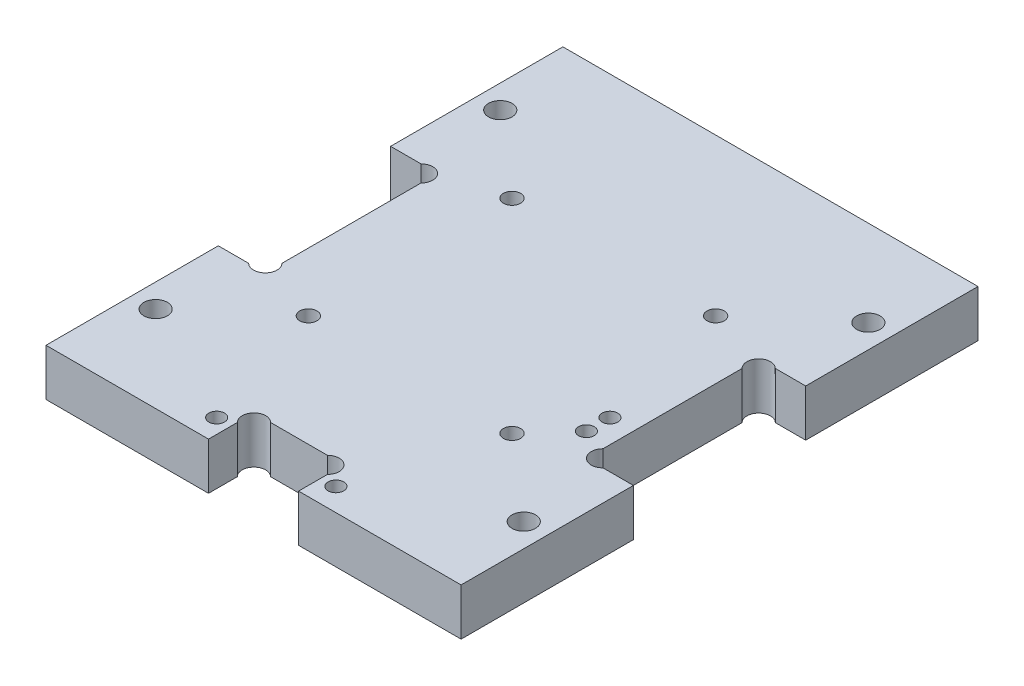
ISO-10303-21;
HEADER;
FILE_DESCRIPTION(('STEP AP214'),'2;1');
FILE_NAME('part.step','',(''),(''),'','','');
FILE_SCHEMA(('AUTOMOTIVE_DESIGN { 1 0 10303 214 1 1 1 1 }'));
ENDSEC;
DATA;
#1=APPLICATION_CONTEXT('core data for automotive mechanical design processes');
#2=APPLICATION_PROTOCOL_DEFINITION('international standard','automotive_design',2000,#1);
#3=PRODUCT_CONTEXT('',#1,'mechanical');
#4=PRODUCT('Part','Part','',(#3));
#5=PRODUCT_RELATED_PRODUCT_CATEGORY('part','',(#4));
#6=PRODUCT_DEFINITION_FORMATION('','',#4);
#7=PRODUCT_DEFINITION_CONTEXT('part definition',#1,'design');
#8=PRODUCT_DEFINITION('design','',#6,#7);
#9=PRODUCT_DEFINITION_SHAPE('','',#8);
#10=(LENGTH_UNIT() NAMED_UNIT(*) SI_UNIT(.MILLI.,.METRE.));
#11=(NAMED_UNIT(*) PLANE_ANGLE_UNIT() SI_UNIT($,.RADIAN.));
#12=(NAMED_UNIT(*) SI_UNIT($,.STERADIAN.) SOLID_ANGLE_UNIT());
#13=UNCERTAINTY_MEASURE_WITH_UNIT(LENGTH_MEASURE(1.E-05),#10,'distance_accuracy_value','');
#14=(GEOMETRIC_REPRESENTATION_CONTEXT(3) GLOBAL_UNCERTAINTY_ASSIGNED_CONTEXT((#13)) GLOBAL_UNIT_ASSIGNED_CONTEXT((#10,
#11,#12)) REPRESENTATION_CONTEXT('',''));
#15=CARTESIAN_POINT('',(0.,0.,0.));
#16=DIRECTION('',(0.,0.,1.));
#17=DIRECTION('',(1.,0.,0.));
#18=AXIS2_PLACEMENT_3D('',#15,#16,#17);
#19=CARTESIAN_POINT('',(-12.0606601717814,6.,-9.93933982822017));
#20=DIRECTION('',(0.,1.,0.));
#21=DIRECTION('',(0.,0.,1.));
#22=AXIS2_PLACEMENT_3D('',#19,#20,#21);
#23=PLANE('',#22);
#24=CARTESIAN_POINT('',(26.9999999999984,6.,5.));
#25=DIRECTION('',(0.,1.,0.));
#26=DIRECTION('',(0.,0.,1.));
#27=AXIS2_PLACEMENT_3D('',#24,#25,#26);
#28=CIRCLE('',#27,1.);
#29=CARTESIAN_POINT('',(26.9999999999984,6.,6.));
#30=VERTEX_POINT('',#29);
#31=EDGE_CURVE('E521',#30,#30,#28,.T.);
#32=ORIENTED_EDGE('',*,*,#31,.F.);
#33=EDGE_LOOP('',(#32));
#34=FACE_BOUND('',#33,.T.);
#35=CARTESIAN_POINT('',(1.88999999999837,6.,30.1));
#36=DIRECTION('',(0.,1.,0.));
#37=DIRECTION('',(0.,0.,1.));
#38=AXIS2_PLACEMENT_3D('',#35,#36,#37);
#39=CIRCLE('',#38,1.);
#40=CARTESIAN_POINT('',(1.88999999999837,6.,31.1));
#41=VERTEX_POINT('',#40);
#42=EDGE_CURVE('E533',#41,#41,#39,.T.);
#43=ORIENTED_EDGE('',*,*,#42,.F.);
#44=EDGE_LOOP('',(#43));
#45=FACE_BOUND('',#44,.T.);
#46=CARTESIAN_POINT('',(22.4999999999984,6.,-13.));
#47=DIRECTION('',(0.,1.,0.));
#48=DIRECTION('',(0.,0.,-1.));
#49=AXIS2_PLACEMENT_3D('',#46,#47,#48);
#50=CIRCLE('',#49,1.1);
#51=CARTESIAN_POINT('',(22.4999999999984,6.,-14.1));
#52=VERTEX_POINT('',#51);
#53=EDGE_CURVE('E545',#52,#52,#50,.T.);
#54=ORIENTED_EDGE('',*,*,#53,.F.);
#55=EDGE_LOOP('',(#54));
#56=FACE_BOUND('',#55,.T.);
#57=CARTESIAN_POINT('',(22.4999999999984,6.,13.));
#58=DIRECTION('',(0.,1.,0.));
#59=DIRECTION('',(0.,0.,1.));
#60=AXIS2_PLACEMENT_3D('',#57,#58,#59);
#61=CIRCLE('',#60,1.1);
#62=CARTESIAN_POINT('',(22.4999999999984,6.,14.1));
#63=VERTEX_POINT('',#62);
#64=EDGE_CURVE('E557',#63,#63,#61,.T.);
#65=ORIENTED_EDGE('',*,*,#64,.F.);
#66=EDGE_LOOP('',(#65));
#67=FACE_BOUND('',#66,.T.);
#68=CARTESIAN_POINT('',(-14.0000000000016,6.,22.));
#69=DIRECTION('',(0.,1.,0.));
#70=DIRECTION('',(0.,0.,-1.));
#71=AXIS2_PLACEMENT_3D('',#68,#69,#70);
#72=CIRCLE('',#71,1.5);
#73=CARTESIAN_POINT('',(-14.0000000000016,6.,20.5));
#74=VERTEX_POINT('',#73);
#75=EDGE_CURVE('E569',#74,#74,#72,.T.);
#76=ORIENTED_EDGE('',*,*,#75,.F.);
#77=EDGE_LOOP('',(#76));
#78=FACE_BOUND('',#77,.T.);
#79=CARTESIAN_POINT('',(-14.0000000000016,6.,-22.));
#80=DIRECTION('',(0.,1.,0.));
#81=DIRECTION('',(0.,0.,1.));
#82=AXIS2_PLACEMENT_3D('',#79,#80,#81);
#83=CIRCLE('',#82,1.5);
#84=CARTESIAN_POINT('',(-14.0000000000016,6.,-20.5));
#85=VERTEX_POINT('',#84);
#86=EDGE_CURVE('E203',#85,#85,#83,.T.);
#87=ORIENTED_EDGE('',*,*,#86,.F.);
#88=EDGE_LOOP('',(#87));
#89=FACE_BOUND('',#88,.T.);
#90=CARTESIAN_POINT('',(-12.0606601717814,6.,-9.93933982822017));
#91=DIRECTION('',(0.,-1.,0.));
#92=DIRECTION('',(0.,0.,1.));
#93=AXIS2_PLACEMENT_3D('',#90,#91,#92);
#94=CIRCLE('',#93,1.5);
#95=CARTESIAN_POINT('',(-13.1213203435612,6.,-11.));
#96=VERTEX_POINT('',#95);
#97=CARTESIAN_POINT('',(-11.0000000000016,6.,-8.87867965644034));
#98=VERTEX_POINT('',#97);
#99=EDGE_CURVE('E249',#96,#98,#94,.T.);
#100=ORIENTED_EDGE('',*,*,#99,.T.);
#101=DIRECTION('',(0.,0.,1.));
#102=VECTOR('',#101,1.);
#103=CARTESIAN_POINT('',(-11.0000000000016,6.,8.87867965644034));
#104=LINE('',#103,#102);
#105=CARTESIAN_POINT('',(-11.0000000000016,6.,8.87867965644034));
#106=VERTEX_POINT('',#105);
#107=EDGE_CURVE('E198',#98,#106,#104,.T.);
#108=ORIENTED_EDGE('',*,*,#107,.T.);
#109=CARTESIAN_POINT('',(-12.0606601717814,6.,9.93933982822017));
#110=DIRECTION('',(0.,-1.,0.));
#111=DIRECTION('',(0.,0.,-1.));
#112=AXIS2_PLACEMENT_3D('',#109,#110,#111);
#113=CIRCLE('',#112,1.5);
#114=CARTESIAN_POINT('',(-13.1213203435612,6.,11.));
#115=VERTEX_POINT('',#114);
#116=EDGE_CURVE('E252',#106,#115,#113,.T.);
#117=ORIENTED_EDGE('',*,*,#116,.T.);
#118=DIRECTION('',(-1.,0.,0.));
#119=VECTOR('',#118,1.);
#120=CARTESIAN_POINT('',(-13.1213203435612,6.,11.));
#121=LINE('',#120,#119);
#122=CARTESIAN_POINT('',(-17.0000000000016,6.,11.));
#123=VERTEX_POINT('',#122);
#124=EDGE_CURVE('E254',#115,#123,#121,.T.);
#125=ORIENTED_EDGE('',*,*,#124,.T.);
#126=DIRECTION('',(0.,0.,1.));
#127=VECTOR('',#126,1.);
#128=CARTESIAN_POINT('',(-17.0000000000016,6.,33.));
#129=LINE('',#128,#127);
#130=CARTESIAN_POINT('',(-17.0000000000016,6.,33.));
#131=VERTEX_POINT('',#130);
#132=EDGE_CURVE('E256',#123,#131,#129,.T.);
#133=ORIENTED_EDGE('',*,*,#132,.T.);
#134=DIRECTION('',(1.,0.,0.));
#135=VECTOR('',#134,1.);
#136=CARTESIAN_POINT('',(3.74999999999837,6.,33.));
#137=LINE('',#136,#135);
#138=CARTESIAN_POINT('',(3.74999999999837,6.,33.));
#139=VERTEX_POINT('',#138);
#140=EDGE_CURVE('E258',#131,#139,#137,.T.);
#141=ORIENTED_EDGE('',*,*,#140,.T.);
#142=DIRECTION('',(0.,0.,-1.));
#143=VECTOR('',#142,1.);
#144=CARTESIAN_POINT('',(3.74999999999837,6.,33.));
#145=LINE('',#144,#143);
#146=CARTESIAN_POINT('',(3.74999999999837,6.,29.3213203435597));
#147=VERTEX_POINT('',#146);
#148=EDGE_CURVE('E260',#139,#147,#145,.T.);
#149=ORIENTED_EDGE('',*,*,#148,.T.);
#150=CARTESIAN_POINT('',(4.81066017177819,6.,28.2606601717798));
#151=DIRECTION('',(0.,-1.,0.));
#152=DIRECTION('',(0.,0.,1.));
#153=AXIS2_PLACEMENT_3D('',#150,#151,#152);
#154=CIRCLE('',#153,1.5);
#155=CARTESIAN_POINT('',(5.87132034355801,6.,27.2));
#156=VERTEX_POINT('',#155);
#157=EDGE_CURVE('E262',#147,#156,#154,.T.);
#158=ORIENTED_EDGE('',*,*,#157,.T.);
#159=DIRECTION('',(1.,0.,0.));
#160=VECTOR('',#159,1.);
#161=CARTESIAN_POINT('',(5.87132034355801,6.,27.2));
#162=LINE('',#161,#160);
#163=CARTESIAN_POINT('',(13.1286796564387,6.,27.2));
#164=VERTEX_POINT('',#163);
#165=EDGE_CURVE('E264',#156,#164,#162,.T.);
#166=ORIENTED_EDGE('',*,*,#165,.T.);
#167=CARTESIAN_POINT('',(14.1893398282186,6.,28.2606601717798));
#168=DIRECTION('',(0.,-1.,0.));
#169=DIRECTION('',(0.,0.,-1.));
#170=AXIS2_PLACEMENT_3D('',#167,#168,#169);
#171=CIRCLE('',#170,1.5);
#172=CARTESIAN_POINT('',(15.2499999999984,6.,29.3213203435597));
#173=VERTEX_POINT('',#172);
#174=EDGE_CURVE('E266',#164,#173,#171,.T.);
#175=ORIENTED_EDGE('',*,*,#174,.T.);
#176=DIRECTION('',(0.,0.,1.));
#177=VECTOR('',#176,1.);
#178=CARTESIAN_POINT('',(15.2499999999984,6.,33.));
#179=LINE('',#178,#177);
#180=CARTESIAN_POINT('',(15.2499999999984,6.,33.));
#181=VERTEX_POINT('',#180);
#182=EDGE_CURVE('E268',#173,#181,#179,.T.);
#183=ORIENTED_EDGE('',*,*,#182,.T.);
#184=DIRECTION('',(1.,0.,0.));
#185=VECTOR('',#184,1.);
#186=CARTESIAN_POINT('',(35.9999999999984,6.,33.));
#187=LINE('',#186,#185);
#188=CARTESIAN_POINT('',(35.9999999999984,6.,33.));
#189=VERTEX_POINT('',#188);
#190=EDGE_CURVE('E270',#181,#189,#187,.T.);
#191=ORIENTED_EDGE('',*,*,#190,.T.);
#192=DIRECTION('',(0.,0.,-1.));
#193=VECTOR('',#192,1.);
#194=CARTESIAN_POINT('',(35.9999999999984,6.,11.));
#195=LINE('',#194,#193);
#196=CARTESIAN_POINT('',(35.9999999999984,6.,11.));
#197=VERTEX_POINT('',#196);
#198=EDGE_CURVE('E272',#189,#197,#195,.T.);
#199=ORIENTED_EDGE('',*,*,#198,.T.);
#200=DIRECTION('',(-1.,0.,0.));
#201=VECTOR('',#200,1.);
#202=CARTESIAN_POINT('',(32.121320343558,6.,11.));
#203=LINE('',#202,#201);
#204=CARTESIAN_POINT('',(32.121320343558,6.,11.));
#205=VERTEX_POINT('',#204);
#206=EDGE_CURVE('E274',#197,#205,#203,.T.);
#207=ORIENTED_EDGE('',*,*,#206,.T.);
#208=CARTESIAN_POINT('',(31.0606601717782,6.,9.93933982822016));
#209=DIRECTION('',(0.,-1.,0.));
#210=DIRECTION('',(0.,0.,1.));
#211=AXIS2_PLACEMENT_3D('',#208,#209,#210);
#212=CIRCLE('',#211,1.5);
#213=CARTESIAN_POINT('',(29.9999999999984,6.,8.87867965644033));
#214=VERTEX_POINT('',#213);
#215=EDGE_CURVE('E276',#205,#214,#212,.T.);
#216=ORIENTED_EDGE('',*,*,#215,.T.);
#217=DIRECTION('',(0.,0.,-1.));
#218=VECTOR('',#217,1.);
#219=CARTESIAN_POINT('',(29.9999999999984,6.,8.87867965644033));
#220=LINE('',#219,#218);
#221=CARTESIAN_POINT('',(29.9999999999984,6.,-8.87867965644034));
#222=VERTEX_POINT('',#221);
#223=EDGE_CURVE('E278',#214,#222,#220,.T.);
#224=ORIENTED_EDGE('',*,*,#223,.T.);
#225=CARTESIAN_POINT('',(31.0606601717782,6.,-9.93933982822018));
#226=DIRECTION('',(0.,-1.,0.));
#227=DIRECTION('',(0.,0.,-1.));
#228=AXIS2_PLACEMENT_3D('',#225,#226,#227);
#229=CIRCLE('',#228,1.5);
#230=CARTESIAN_POINT('',(32.121320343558,6.,-11.));
#231=VERTEX_POINT('',#230);
#232=EDGE_CURVE('E280',#222,#231,#229,.T.);
#233=ORIENTED_EDGE('',*,*,#232,.T.);
#234=DIRECTION('',(1.,0.,0.));
#235=VECTOR('',#234,1.);
#236=CARTESIAN_POINT('',(32.121320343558,6.,-11.));
#237=LINE('',#236,#235);
#238=CARTESIAN_POINT('',(35.9999999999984,6.,-11.));
#239=VERTEX_POINT('',#238);
#240=EDGE_CURVE('E282',#231,#239,#237,.T.);
#241=ORIENTED_EDGE('',*,*,#240,.T.);
#242=DIRECTION('',(0.,0.,-1.));
#243=VECTOR('',#242,1.);
#244=CARTESIAN_POINT('',(35.9999999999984,6.,-33.));
#245=LINE('',#244,#243);
#246=CARTESIAN_POINT('',(35.9999999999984,6.,-33.));
#247=VERTEX_POINT('',#246);
#248=EDGE_CURVE('E284',#239,#247,#245,.T.);
#249=ORIENTED_EDGE('',*,*,#248,.T.);
#250=DIRECTION('',(-1.,0.,0.));
#251=VECTOR('',#250,1.);
#252=CARTESIAN_POINT('',(-17.0000000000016,6.,-33.));
#253=LINE('',#252,#251);
#254=CARTESIAN_POINT('',(-17.0000000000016,6.,-33.));
#255=VERTEX_POINT('',#254);
#256=EDGE_CURVE('E286',#247,#255,#253,.T.);
#257=ORIENTED_EDGE('',*,*,#256,.T.);
#258=DIRECTION('',(0.,0.,1.));
#259=VECTOR('',#258,1.);
#260=CARTESIAN_POINT('',(-17.0000000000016,6.,-11.));
#261=LINE('',#260,#259);
#262=CARTESIAN_POINT('',(-17.0000000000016,6.,-11.));
#263=VERTEX_POINT('',#262);
#264=EDGE_CURVE('E55',#255,#263,#261,.T.);
#265=ORIENTED_EDGE('',*,*,#264,.T.);
#266=DIRECTION('',(1.,0.,0.));
#267=VECTOR('',#266,1.);
#268=CARTESIAN_POINT('',(-13.1213203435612,6.,-11.));
#269=LINE('',#268,#267);
#270=EDGE_CURVE('E50',#263,#96,#269,.T.);
#271=ORIENTED_EDGE('',*,*,#270,.T.);
#272=EDGE_LOOP('',(#100,#108,#117,#125,#133,#141,#149,#158,#166,#175,#183,#191,#199,#207,#216,
#224,#233,#241,#249,#257,#265,#271));
#273=FACE_BOUND('',#272,.T.);
#274=CARTESIAN_POINT('',(32.9999999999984,6.,-22.));
#275=DIRECTION('',(0.,1.,0.));
#276=DIRECTION('',(0.,0.,-1.));
#277=AXIS2_PLACEMENT_3D('',#274,#275,#276);
#278=CIRCLE('',#277,1.5);
#279=CARTESIAN_POINT('',(32.9999999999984,6.,-23.5));
#280=VERTEX_POINT('',#279);
#281=EDGE_CURVE('E575',#280,#280,#278,.T.);
#282=ORIENTED_EDGE('',*,*,#281,.F.);
#283=EDGE_LOOP('',(#282));
#284=FACE_BOUND('',#283,.T.);
#285=CARTESIAN_POINT('',(32.9999999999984,6.,22.));
#286=DIRECTION('',(0.,1.,0.));
#287=DIRECTION('',(0.,0.,1.));
#288=AXIS2_PLACEMENT_3D('',#285,#286,#287);
#289=CIRCLE('',#288,1.5);
#290=CARTESIAN_POINT('',(32.9999999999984,6.,23.5));
#291=VERTEX_POINT('',#290);
#292=EDGE_CURVE('E563',#291,#291,#289,.T.);
#293=ORIENTED_EDGE('',*,*,#292,.F.);
#294=EDGE_LOOP('',(#293));
#295=FACE_BOUND('',#294,.T.);
#296=CARTESIAN_POINT('',(-3.50000000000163,6.,13.));
#297=DIRECTION('',(0.,1.,0.));
#298=DIRECTION('',(0.,0.,1.));
#299=AXIS2_PLACEMENT_3D('',#296,#297,#298);
#300=CIRCLE('',#299,1.1);
#301=CARTESIAN_POINT('',(-3.50000000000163,6.,14.1));
#302=VERTEX_POINT('',#301);
#303=EDGE_CURVE('E551',#302,#302,#300,.T.);
#304=ORIENTED_EDGE('',*,*,#303,.F.);
#305=EDGE_LOOP('',(#304));
#306=FACE_BOUND('',#305,.T.);
#307=CARTESIAN_POINT('',(-3.50000000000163,6.,-13.));
#308=DIRECTION('',(0.,1.,0.));
#309=DIRECTION('',(0.,0.,-1.));
#310=AXIS2_PLACEMENT_3D('',#307,#308,#309);
#311=CIRCLE('',#310,1.1);
#312=CARTESIAN_POINT('',(-3.50000000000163,6.,-14.1));
#313=VERTEX_POINT('',#312);
#314=EDGE_CURVE('E539',#313,#313,#311,.T.);
#315=ORIENTED_EDGE('',*,*,#314,.F.);
#316=EDGE_LOOP('',(#315));
#317=FACE_BOUND('',#316,.T.);
#318=CARTESIAN_POINT('',(17.1099999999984,6.,30.1));
#319=DIRECTION('',(0.,1.,0.));
#320=DIRECTION('',(0.,0.,-1.));
#321=AXIS2_PLACEMENT_3D('',#318,#319,#320);
#322=CIRCLE('',#321,1.);
#323=CARTESIAN_POINT('',(17.1099999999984,6.,29.1));
#324=VERTEX_POINT('',#323);
#325=EDGE_CURVE('E527',#324,#324,#322,.T.);
#326=ORIENTED_EDGE('',*,*,#325,.F.);
#327=EDGE_LOOP('',(#326));
#328=FACE_BOUND('',#327,.T.);
#329=CARTESIAN_POINT('',(26.9999999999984,6.,8.));
#330=DIRECTION('',(0.,1.,0.));
#331=DIRECTION('',(0.,0.,1.));
#332=AXIS2_PLACEMENT_3D('',#329,#330,#331);
#333=CIRCLE('',#332,1.);
#334=CARTESIAN_POINT('',(26.9999999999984,6.,9.));
#335=VERTEX_POINT('',#334);
#336=EDGE_CURVE('E510',#335,#335,#333,.T.);
#337=ORIENTED_EDGE('',*,*,#336,.F.);
#338=EDGE_LOOP('',(#337));
#339=FACE_BOUND('',#338,.T.);
#340=ADVANCED_FACE('F35',(#34,#45,#56,#67,#78,#89,#273,#284,#295,#306,#317,#328,#339),#23,.T.);
#341=CARTESIAN_POINT('',(-12.0606601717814,0.,-9.93933982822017));
#342=DIRECTION('',(0.,1.,0.));
#343=DIRECTION('',(0.,0.,1.));
#344=AXIS2_PLACEMENT_3D('',#341,#342,#343);
#345=PLANE('',#344);
#346=CARTESIAN_POINT('',(26.9999999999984,0.,5.));
#347=DIRECTION('',(0.,1.,0.));
#348=DIRECTION('',(0.,0.,1.));
#349=AXIS2_PLACEMENT_3D('',#346,#347,#348);
#350=CIRCLE('',#349,1.);
#351=CARTESIAN_POINT('',(26.9999999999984,0.,6.));
#352=VERTEX_POINT('',#351);
#353=EDGE_CURVE('E516',#352,#352,#350,.T.);
#354=ORIENTED_EDGE('',*,*,#353,.T.);
#355=EDGE_LOOP('',(#354));
#356=FACE_BOUND('',#355,.T.);
#357=CARTESIAN_POINT('',(1.88999999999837,0.,30.1));
#358=DIRECTION('',(0.,1.,0.));
#359=DIRECTION('',(0.,0.,1.));
#360=AXIS2_PLACEMENT_3D('',#357,#358,#359);
#361=CIRCLE('',#360,1.);
#362=CARTESIAN_POINT('',(1.88999999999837,0.,31.1));
#363=VERTEX_POINT('',#362);
#364=EDGE_CURVE('E530',#363,#363,#361,.T.);
#365=ORIENTED_EDGE('',*,*,#364,.T.);
#366=EDGE_LOOP('',(#365));
#367=FACE_BOUND('',#366,.T.);
#368=CARTESIAN_POINT('',(22.4999999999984,0.,-13.));
#369=DIRECTION('',(0.,1.,0.));
#370=DIRECTION('',(0.,0.,-1.));
#371=AXIS2_PLACEMENT_3D('',#368,#369,#370);
#372=CIRCLE('',#371,1.1);
#373=CARTESIAN_POINT('',(22.4999999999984,0.,-14.1));
#374=VERTEX_POINT('',#373);
#375=EDGE_CURVE('E542',#374,#374,#372,.T.);
#376=ORIENTED_EDGE('',*,*,#375,.T.);
#377=EDGE_LOOP('',(#376));
#378=FACE_BOUND('',#377,.T.);
#379=CARTESIAN_POINT('',(22.4999999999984,0.,13.));
#380=DIRECTION('',(0.,1.,0.));
#381=DIRECTION('',(0.,0.,1.));
#382=AXIS2_PLACEMENT_3D('',#379,#380,#381);
#383=CIRCLE('',#382,1.1);
#384=CARTESIAN_POINT('',(22.4999999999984,0.,14.1));
#385=VERTEX_POINT('',#384);
#386=EDGE_CURVE('E554',#385,#385,#383,.T.);
#387=ORIENTED_EDGE('',*,*,#386,.T.);
#388=EDGE_LOOP('',(#387));
#389=FACE_BOUND('',#388,.T.);
#390=CARTESIAN_POINT('',(-14.0000000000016,0.,22.));
#391=DIRECTION('',(0.,1.,0.));
#392=DIRECTION('',(0.,0.,-1.));
#393=AXIS2_PLACEMENT_3D('',#390,#391,#392);
#394=CIRCLE('',#393,1.5);
#395=CARTESIAN_POINT('',(-14.0000000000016,0.,20.5));
#396=VERTEX_POINT('',#395);
#397=EDGE_CURVE('E566',#396,#396,#394,.T.);
#398=ORIENTED_EDGE('',*,*,#397,.T.);
#399=EDGE_LOOP('',(#398));
#400=FACE_BOUND('',#399,.T.);
#401=CARTESIAN_POINT('',(-14.0000000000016,0.,-22.));
#402=DIRECTION('',(0.,1.,0.));
#403=DIRECTION('',(0.,0.,1.));
#404=AXIS2_PLACEMENT_3D('',#401,#402,#403);
#405=CIRCLE('',#404,1.5);
#406=CARTESIAN_POINT('',(-14.0000000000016,0.,-20.5));
#407=VERTEX_POINT('',#406);
#408=EDGE_CURVE('E206',#407,#407,#405,.T.);
#409=ORIENTED_EDGE('',*,*,#408,.T.);
#410=EDGE_LOOP('',(#409));
#411=FACE_BOUND('',#410,.T.);
#412=CARTESIAN_POINT('',(-12.0606601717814,0.,-9.93933982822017));
#413=DIRECTION('',(0.,-1.,0.));
#414=DIRECTION('',(0.,0.,1.));
#415=AXIS2_PLACEMENT_3D('',#412,#413,#414);
#416=CIRCLE('',#415,1.5);
#417=CARTESIAN_POINT('',(-13.1213203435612,0.,-11.));
#418=VERTEX_POINT('',#417);
#419=CARTESIAN_POINT('',(-11.0000000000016,0.,-8.87867965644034));
#420=VERTEX_POINT('',#419);
#421=EDGE_CURVE('E189',#418,#420,#416,.T.);
#422=ORIENTED_EDGE('',*,*,#421,.F.);
#423=DIRECTION('',(1.,0.,0.));
#424=VECTOR('',#423,1.);
#425=CARTESIAN_POINT('',(-13.1213203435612,0.,-11.));
#426=LINE('',#425,#424);
#427=CARTESIAN_POINT('',(-17.0000000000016,0.,-11.));
#428=VERTEX_POINT('',#427);
#429=EDGE_CURVE('E247',#428,#418,#426,.T.);
#430=ORIENTED_EDGE('',*,*,#429,.F.);
#431=DIRECTION('',(0.,0.,1.));
#432=VECTOR('',#431,1.);
#433=CARTESIAN_POINT('',(-17.0000000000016,0.,-11.));
#434=LINE('',#433,#432);
#435=CARTESIAN_POINT('',(-17.0000000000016,0.,-33.));
#436=VERTEX_POINT('',#435);
#437=EDGE_CURVE('E245',#436,#428,#434,.T.);
#438=ORIENTED_EDGE('',*,*,#437,.F.);
#439=DIRECTION('',(-1.,0.,0.));
#440=VECTOR('',#439,1.);
#441=CARTESIAN_POINT('',(-17.0000000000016,0.,-33.));
#442=LINE('',#441,#440);
#443=CARTESIAN_POINT('',(35.9999999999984,0.,-33.));
#444=VERTEX_POINT('',#443);
#445=EDGE_CURVE('E243',#444,#436,#442,.T.);
#446=ORIENTED_EDGE('',*,*,#445,.F.);
#447=DIRECTION('',(0.,0.,-1.));
#448=VECTOR('',#447,1.);
#449=CARTESIAN_POINT('',(35.9999999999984,0.,-33.));
#450=LINE('',#449,#448);
#451=CARTESIAN_POINT('',(35.9999999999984,0.,-11.));
#452=VERTEX_POINT('',#451);
#453=EDGE_CURVE('E241',#452,#444,#450,.T.);
#454=ORIENTED_EDGE('',*,*,#453,.F.);
#455=DIRECTION('',(1.,0.,0.));
#456=VECTOR('',#455,1.);
#457=CARTESIAN_POINT('',(32.121320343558,0.,-11.));
#458=LINE('',#457,#456);
#459=CARTESIAN_POINT('',(32.121320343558,0.,-11.));
#460=VERTEX_POINT('',#459);
#461=EDGE_CURVE('E239',#460,#452,#458,.T.);
#462=ORIENTED_EDGE('',*,*,#461,.F.);
#463=CARTESIAN_POINT('',(31.0606601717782,0.,-9.93933982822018));
#464=DIRECTION('',(0.,-1.,0.));
#465=DIRECTION('',(0.,0.,-1.));
#466=AXIS2_PLACEMENT_3D('',#463,#464,#465);
#467=CIRCLE('',#466,1.5);
#468=CARTESIAN_POINT('',(29.9999999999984,0.,-8.87867965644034));
#469=VERTEX_POINT('',#468);
#470=EDGE_CURVE('E237',#469,#460,#467,.T.);
#471=ORIENTED_EDGE('',*,*,#470,.F.);
#472=DIRECTION('',(0.,0.,-1.));
#473=VECTOR('',#472,1.);
#474=CARTESIAN_POINT('',(29.9999999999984,0.,8.87867965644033));
#475=LINE('',#474,#473);
#476=CARTESIAN_POINT('',(29.9999999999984,0.,8.87867965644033));
#477=VERTEX_POINT('',#476);
#478=EDGE_CURVE('E235',#477,#469,#475,.T.);
#479=ORIENTED_EDGE('',*,*,#478,.F.);
#480=CARTESIAN_POINT('',(31.0606601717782,0.,9.93933982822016));
#481=DIRECTION('',(0.,-1.,0.));
#482=DIRECTION('',(0.,0.,1.));
#483=AXIS2_PLACEMENT_3D('',#480,#481,#482);
#484=CIRCLE('',#483,1.5);
#485=CARTESIAN_POINT('',(32.121320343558,0.,11.));
#486=VERTEX_POINT('',#485);
#487=EDGE_CURVE('E233',#486,#477,#484,.T.);
#488=ORIENTED_EDGE('',*,*,#487,.F.);
#489=DIRECTION('',(-1.,0.,0.));
#490=VECTOR('',#489,1.);
#491=CARTESIAN_POINT('',(32.121320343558,0.,11.));
#492=LINE('',#491,#490);
#493=CARTESIAN_POINT('',(35.9999999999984,0.,11.));
#494=VERTEX_POINT('',#493);
#495=EDGE_CURVE('E231',#494,#486,#492,.T.);
#496=ORIENTED_EDGE('',*,*,#495,.F.);
#497=DIRECTION('',(0.,0.,-1.));
#498=VECTOR('',#497,1.);
#499=CARTESIAN_POINT('',(35.9999999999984,0.,11.));
#500=LINE('',#499,#498);
#501=CARTESIAN_POINT('',(35.9999999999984,0.,33.));
#502=VERTEX_POINT('',#501);
#503=EDGE_CURVE('E229',#502,#494,#500,.T.);
#504=ORIENTED_EDGE('',*,*,#503,.F.);
#505=DIRECTION('',(1.,0.,0.));
#506=VECTOR('',#505,1.);
#507=CARTESIAN_POINT('',(35.9999999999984,0.,33.));
#508=LINE('',#507,#506);
#509=CARTESIAN_POINT('',(15.2499999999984,0.,33.));
#510=VERTEX_POINT('',#509);
#511=EDGE_CURVE('E227',#510,#502,#508,.T.);
#512=ORIENTED_EDGE('',*,*,#511,.F.);
#513=DIRECTION('',(0.,0.,1.));
#514=VECTOR('',#513,1.);
#515=CARTESIAN_POINT('',(15.2499999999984,0.,33.));
#516=LINE('',#515,#514);
#517=CARTESIAN_POINT('',(15.2499999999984,0.,29.3213203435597));
#518=VERTEX_POINT('',#517);
#519=EDGE_CURVE('E225',#518,#510,#516,.T.);
#520=ORIENTED_EDGE('',*,*,#519,.F.);
#521=CARTESIAN_POINT('',(14.1893398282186,0.,28.2606601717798));
#522=DIRECTION('',(0.,-1.,0.));
#523=DIRECTION('',(0.,0.,-1.));
#524=AXIS2_PLACEMENT_3D('',#521,#522,#523);
#525=CIRCLE('',#524,1.5);
#526=CARTESIAN_POINT('',(13.1286796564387,0.,27.2));
#527=VERTEX_POINT('',#526);
#528=EDGE_CURVE('E223',#527,#518,#525,.T.);
#529=ORIENTED_EDGE('',*,*,#528,.F.);
#530=DIRECTION('',(1.,0.,0.));
#531=VECTOR('',#530,1.);
#532=CARTESIAN_POINT('',(5.87132034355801,0.,27.2));
#533=LINE('',#532,#531);
#534=CARTESIAN_POINT('',(5.87132034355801,0.,27.2));
#535=VERTEX_POINT('',#534);
#536=EDGE_CURVE('E221',#535,#527,#533,.T.);
#537=ORIENTED_EDGE('',*,*,#536,.F.);
#538=CARTESIAN_POINT('',(4.81066017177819,0.,28.2606601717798));
#539=DIRECTION('',(0.,-1.,0.));
#540=DIRECTION('',(0.,0.,1.));
#541=AXIS2_PLACEMENT_3D('',#538,#539,#540);
#542=CIRCLE('',#541,1.5);
#543=CARTESIAN_POINT('',(3.74999999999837,0.,29.3213203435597));
#544=VERTEX_POINT('',#543);
#545=EDGE_CURVE('E219',#544,#535,#542,.T.);
#546=ORIENTED_EDGE('',*,*,#545,.F.);
#547=DIRECTION('',(0.,0.,-1.));
#548=VECTOR('',#547,1.);
#549=CARTESIAN_POINT('',(3.74999999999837,0.,33.));
#550=LINE('',#549,#548);
#551=CARTESIAN_POINT('',(3.74999999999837,0.,33.));
#552=VERTEX_POINT('',#551);
#553=EDGE_CURVE('E217',#552,#544,#550,.T.);
#554=ORIENTED_EDGE('',*,*,#553,.F.);
#555=DIRECTION('',(1.,0.,0.));
#556=VECTOR('',#555,1.);
#557=CARTESIAN_POINT('',(3.74999999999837,0.,33.));
#558=LINE('',#557,#556);
#559=CARTESIAN_POINT('',(-17.0000000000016,0.,33.));
#560=VERTEX_POINT('',#559);
#561=EDGE_CURVE('E215',#560,#552,#558,.T.);
#562=ORIENTED_EDGE('',*,*,#561,.F.);
#563=DIRECTION('',(0.,0.,1.));
#564=VECTOR('',#563,1.);
#565=CARTESIAN_POINT('',(-17.0000000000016,0.,33.));
#566=LINE('',#565,#564);
#567=CARTESIAN_POINT('',(-17.0000000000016,0.,11.));
#568=VERTEX_POINT('',#567);
#569=EDGE_CURVE('E213',#568,#560,#566,.T.);
#570=ORIENTED_EDGE('',*,*,#569,.F.);
#571=DIRECTION('',(-1.,0.,0.));
#572=VECTOR('',#571,1.);
#573=CARTESIAN_POINT('',(-13.1213203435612,0.,11.));
#574=LINE('',#573,#572);
#575=CARTESIAN_POINT('',(-13.1213203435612,0.,11.));
#576=VERTEX_POINT('',#575);
#577=EDGE_CURVE('E211',#576,#568,#574,.T.);
#578=ORIENTED_EDGE('',*,*,#577,.F.);
#579=CARTESIAN_POINT('',(-12.0606601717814,0.,9.93933982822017));
#580=DIRECTION('',(0.,-1.,0.));
#581=DIRECTION('',(0.,0.,-1.));
#582=AXIS2_PLACEMENT_3D('',#579,#580,#581);
#583=CIRCLE('',#582,1.5);
#584=CARTESIAN_POINT('',(-11.0000000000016,0.,8.87867965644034));
#585=VERTEX_POINT('',#584);
#586=EDGE_CURVE('E191',#585,#576,#583,.T.);
#587=ORIENTED_EDGE('',*,*,#586,.F.);
#588=DIRECTION('',(0.,0.,1.));
#589=VECTOR('',#588,1.);
#590=CARTESIAN_POINT('',(-11.0000000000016,0.,8.87867965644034));
#591=LINE('',#590,#589);
#592=EDGE_CURVE('E184',#420,#585,#591,.T.);
#593=ORIENTED_EDGE('',*,*,#592,.F.);
#594=EDGE_LOOP('',(#422,#430,#438,#446,#454,#462,#471,#479,#488,#496,#504,#512,#520,#529,#537,
#546,#554,#562,#570,#578,#587,#593));
#595=FACE_BOUND('',#594,.T.);
#596=CARTESIAN_POINT('',(32.9999999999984,0.,-22.));
#597=DIRECTION('',(0.,1.,0.));
#598=DIRECTION('',(0.,0.,-1.));
#599=AXIS2_PLACEMENT_3D('',#596,#597,#598);
#600=CIRCLE('',#599,1.5);
#601=CARTESIAN_POINT('',(32.9999999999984,0.,-23.5));
#602=VERTEX_POINT('',#601);
#603=EDGE_CURVE('E572',#602,#602,#600,.T.);
#604=ORIENTED_EDGE('',*,*,#603,.T.);
#605=EDGE_LOOP('',(#604));
#606=FACE_BOUND('',#605,.T.);
#607=CARTESIAN_POINT('',(32.9999999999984,0.,22.));
#608=DIRECTION('',(0.,1.,0.));
#609=DIRECTION('',(0.,0.,1.));
#610=AXIS2_PLACEMENT_3D('',#607,#608,#609);
#611=CIRCLE('',#610,1.5);
#612=CARTESIAN_POINT('',(32.9999999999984,0.,23.5));
#613=VERTEX_POINT('',#612);
#614=EDGE_CURVE('E560',#613,#613,#611,.T.);
#615=ORIENTED_EDGE('',*,*,#614,.T.);
#616=EDGE_LOOP('',(#615));
#617=FACE_BOUND('',#616,.T.);
#618=CARTESIAN_POINT('',(-3.50000000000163,0.,13.));
#619=DIRECTION('',(0.,1.,0.));
#620=DIRECTION('',(0.,0.,1.));
#621=AXIS2_PLACEMENT_3D('',#618,#619,#620);
#622=CIRCLE('',#621,1.1);
#623=CARTESIAN_POINT('',(-3.50000000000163,0.,14.1));
#624=VERTEX_POINT('',#623);
#625=EDGE_CURVE('E548',#624,#624,#622,.T.);
#626=ORIENTED_EDGE('',*,*,#625,.T.);
#627=EDGE_LOOP('',(#626));
#628=FACE_BOUND('',#627,.T.);
#629=CARTESIAN_POINT('',(-3.50000000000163,0.,-13.));
#630=DIRECTION('',(0.,1.,0.));
#631=DIRECTION('',(0.,0.,-1.));
#632=AXIS2_PLACEMENT_3D('',#629,#630,#631);
#633=CIRCLE('',#632,1.1);
#634=CARTESIAN_POINT('',(-3.50000000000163,0.,-14.1));
#635=VERTEX_POINT('',#634);
#636=EDGE_CURVE('E536',#635,#635,#633,.T.);
#637=ORIENTED_EDGE('',*,*,#636,.T.);
#638=EDGE_LOOP('',(#637));
#639=FACE_BOUND('',#638,.T.);
#640=CARTESIAN_POINT('',(17.1099999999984,0.,30.1));
#641=DIRECTION('',(0.,1.,0.));
#642=DIRECTION('',(0.,0.,-1.));
#643=AXIS2_PLACEMENT_3D('',#640,#641,#642);
#644=CIRCLE('',#643,1.);
#645=CARTESIAN_POINT('',(17.1099999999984,0.,29.1));
#646=VERTEX_POINT('',#645);
#647=EDGE_CURVE('E524',#646,#646,#644,.T.);
#648=ORIENTED_EDGE('',*,*,#647,.T.);
#649=EDGE_LOOP('',(#648));
#650=FACE_BOUND('',#649,.T.);
#651=CARTESIAN_POINT('',(26.9999999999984,0.,8.));
#652=DIRECTION('',(0.,1.,0.));
#653=DIRECTION('',(0.,0.,1.));
#654=AXIS2_PLACEMENT_3D('',#651,#652,#653);
#655=CIRCLE('',#654,1.);
#656=CARTESIAN_POINT('',(26.9999999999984,0.,9.));
#657=VERTEX_POINT('',#656);
#658=EDGE_CURVE('E513',#657,#657,#655,.T.);
#659=ORIENTED_EDGE('',*,*,#658,.T.);
#660=EDGE_LOOP('',(#659));
#661=FACE_BOUND('',#660,.T.);
#662=ADVANCED_FACE('F185',(#356,#367,#378,#389,#400,#411,#595,#606,#617,#628,#639,#650,#661),
#345,.F.);
#663=CARTESIAN_POINT('',(-12.0606601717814,6.,-9.93933982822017));
#664=DIRECTION('',(0.,-1.,0.));
#665=DIRECTION('',(0.,0.,-1.));
#666=AXIS2_PLACEMENT_3D('',#663,#664,#665);
#667=CYLINDRICAL_SURFACE('',#666,1.5);
#668=ORIENTED_EDGE('',*,*,#421,.T.);
#669=DIRECTION('',(0.,-1.,0.));
#670=VECTOR('',#669,1.);
#671=CARTESIAN_POINT('',(-11.0000000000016,6.,-8.87867965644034));
#672=LINE('',#671,#670);
#673=EDGE_CURVE('E11',#98,#420,#672,.T.);
#674=ORIENTED_EDGE('',*,*,#673,.F.);
#675=ORIENTED_EDGE('',*,*,#99,.F.);
#676=DIRECTION('',(0.,-1.,0.));
#677=VECTOR('',#676,1.);
#678=CARTESIAN_POINT('',(-13.1213203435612,6.,-11.));
#679=LINE('',#678,#677);
#680=EDGE_CURVE('E202',#96,#418,#679,.T.);
#681=ORIENTED_EDGE('',*,*,#680,.T.);
#682=EDGE_LOOP('',(#668,#674,#675,#681));
#683=FACE_BOUND('',#682,.T.);
#684=ADVANCED_FACE('F37',(#683),#667,.F.);
#685=CARTESIAN_POINT('',(-11.0000000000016,6.,8.87867965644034));
#686=DIRECTION('',(1.,0.,0.));
#687=DIRECTION('',(0.,0.,-1.));
#688=AXIS2_PLACEMENT_3D('',#685,#686,#687);
#689=PLANE('',#688);
#690=ORIENTED_EDGE('',*,*,#592,.T.);
#691=DIRECTION('',(0.,-1.,0.));
#692=VECTOR('',#691,1.);
#693=CARTESIAN_POINT('',(-11.0000000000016,6.,8.87867965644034));
#694=LINE('',#693,#692);
#695=EDGE_CURVE('E43',#106,#585,#694,.T.);
#696=ORIENTED_EDGE('',*,*,#695,.F.);
#697=ORIENTED_EDGE('',*,*,#107,.F.);
#698=ORIENTED_EDGE('',*,*,#673,.T.);
#699=EDGE_LOOP('',(#690,#696,#697,#698));
#700=FACE_BOUND('',#699,.T.);
#701=ADVANCED_FACE('F197',(#700),#689,.F.);
#702=CARTESIAN_POINT('',(-12.0606601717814,6.,9.93933982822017));
#703=DIRECTION('',(0.,-1.,0.));
#704=DIRECTION('',(0.,0.,-1.));
#705=AXIS2_PLACEMENT_3D('',#702,#703,#704);
#706=CYLINDRICAL_SURFACE('',#705,1.5);
#707=ORIENTED_EDGE('',*,*,#586,.T.);
#708=DIRECTION('',(0.,-1.,0.));
#709=VECTOR('',#708,1.);
#710=CARTESIAN_POINT('',(-13.1213203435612,6.,11.));
#711=LINE('',#710,#709);
#712=EDGE_CURVE('E345',#115,#576,#711,.T.);
#713=ORIENTED_EDGE('',*,*,#712,.F.);
#714=ORIENTED_EDGE('',*,*,#116,.F.);
#715=ORIENTED_EDGE('',*,*,#695,.T.);
#716=EDGE_LOOP('',(#707,#713,#714,#715));
#717=FACE_BOUND('',#716,.T.);
#718=ADVANCED_FACE('F349',(#717),#706,.F.);
#719=CARTESIAN_POINT('',(-13.1213203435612,6.,11.));
#720=DIRECTION('',(0.,0.,1.));
#721=DIRECTION('',(1.,0.,0.));
#722=AXIS2_PLACEMENT_3D('',#719,#720,#721);
#723=PLANE('',#722);
#724=ORIENTED_EDGE('',*,*,#577,.T.);
#725=DIRECTION('',(0.,-1.,0.));
#726=VECTOR('',#725,1.);
#727=CARTESIAN_POINT('',(-17.0000000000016,6.,11.));
#728=LINE('',#727,#726);
#729=EDGE_CURVE('E342',#123,#568,#728,.T.);
#730=ORIENTED_EDGE('',*,*,#729,.F.);
#731=ORIENTED_EDGE('',*,*,#124,.F.);
#732=ORIENTED_EDGE('',*,*,#712,.T.);
#733=EDGE_LOOP('',(#724,#730,#731,#732));
#734=FACE_BOUND('',#733,.T.);
#735=ADVANCED_FACE('F357',(#734),#723,.F.);
#736=CARTESIAN_POINT('',(-17.0000000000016,6.,33.));
#737=DIRECTION('',(1.,0.,0.));
#738=DIRECTION('',(0.,0.,-1.));
#739=AXIS2_PLACEMENT_3D('',#736,#737,#738);
#740=PLANE('',#739);
#741=ORIENTED_EDGE('',*,*,#569,.T.);
#742=DIRECTION('',(0.,-1.,0.));
#743=VECTOR('',#742,1.);
#744=CARTESIAN_POINT('',(-17.0000000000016,6.,33.));
#745=LINE('',#744,#743);
#746=EDGE_CURVE('E339',#131,#560,#745,.T.);
#747=ORIENTED_EDGE('',*,*,#746,.F.);
#748=ORIENTED_EDGE('',*,*,#132,.F.);
#749=ORIENTED_EDGE('',*,*,#729,.T.);
#750=EDGE_LOOP('',(#741,#747,#748,#749));
#751=FACE_BOUND('',#750,.T.);
#752=ADVANCED_FACE('F360',(#751),#740,.F.);
#753=CARTESIAN_POINT('',(3.74999999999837,6.,33.));
#754=DIRECTION('',(0.,0.,-1.));
#755=DIRECTION('',(-1.,0.,0.));
#756=AXIS2_PLACEMENT_3D('',#753,#754,#755);
#757=PLANE('',#756);
#758=ORIENTED_EDGE('',*,*,#561,.T.);
#759=DIRECTION('',(0.,-1.,0.));
#760=VECTOR('',#759,1.);
#761=CARTESIAN_POINT('',(3.74999999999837,6.,33.));
#762=LINE('',#761,#760);
#763=EDGE_CURVE('E336',#139,#552,#762,.T.);
#764=ORIENTED_EDGE('',*,*,#763,.F.);
#765=ORIENTED_EDGE('',*,*,#140,.F.);
#766=ORIENTED_EDGE('',*,*,#746,.T.);
#767=EDGE_LOOP('',(#758,#764,#765,#766));
#768=FACE_BOUND('',#767,.T.);
#769=ADVANCED_FACE('F365',(#768),#757,.F.);
#770=CARTESIAN_POINT('',(3.74999999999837,6.,33.));
#771=DIRECTION('',(-1.,0.,0.));
#772=DIRECTION('',(0.,0.,1.));
#773=AXIS2_PLACEMENT_3D('',#770,#771,#772);
#774=PLANE('',#773);
#775=ORIENTED_EDGE('',*,*,#553,.T.);
#776=DIRECTION('',(0.,-1.,0.));
#777=VECTOR('',#776,1.);
#778=CARTESIAN_POINT('',(3.74999999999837,6.,29.3213203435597));
#779=LINE('',#778,#777);
#780=EDGE_CURVE('E333',#147,#544,#779,.T.);
#781=ORIENTED_EDGE('',*,*,#780,.F.);
#782=ORIENTED_EDGE('',*,*,#148,.F.);
#783=ORIENTED_EDGE('',*,*,#763,.T.);
#784=EDGE_LOOP('',(#775,#781,#782,#783));
#785=FACE_BOUND('',#784,.T.);
#786=ADVANCED_FACE('F371',(#785),#774,.F.);
#787=CARTESIAN_POINT('',(4.81066017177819,6.,28.2606601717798));
#788=DIRECTION('',(0.,-1.,0.));
#789=DIRECTION('',(0.,0.,-1.));
#790=AXIS2_PLACEMENT_3D('',#787,#788,#789);
#791=CYLINDRICAL_SURFACE('',#790,1.5);
#792=ORIENTED_EDGE('',*,*,#545,.T.);
#793=DIRECTION('',(0.,-1.,0.));
#794=VECTOR('',#793,1.);
#795=CARTESIAN_POINT('',(5.87132034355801,6.,27.2));
#796=LINE('',#795,#794);
#797=EDGE_CURVE('E330',#156,#535,#796,.T.);
#798=ORIENTED_EDGE('',*,*,#797,.F.);
#799=ORIENTED_EDGE('',*,*,#157,.F.);
#800=ORIENTED_EDGE('',*,*,#780,.T.);
#801=EDGE_LOOP('',(#792,#798,#799,#800));
#802=FACE_BOUND('',#801,.T.);
#803=ADVANCED_FACE('F375',(#802),#791,.F.);
#804=CARTESIAN_POINT('',(5.87132034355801,6.,27.2));
#805=DIRECTION('',(0.,0.,-1.));
#806=DIRECTION('',(-1.,0.,0.));
#807=AXIS2_PLACEMENT_3D('',#804,#805,#806);
#808=PLANE('',#807);
#809=ORIENTED_EDGE('',*,*,#536,.T.);
#810=DIRECTION('',(0.,-1.,0.));
#811=VECTOR('',#810,1.);
#812=CARTESIAN_POINT('',(13.1286796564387,6.,27.2));
#813=LINE('',#812,#811);
#814=EDGE_CURVE('E327',#164,#527,#813,.T.);
#815=ORIENTED_EDGE('',*,*,#814,.F.);
#816=ORIENTED_EDGE('',*,*,#165,.F.);
#817=ORIENTED_EDGE('',*,*,#797,.T.);
#818=EDGE_LOOP('',(#809,#815,#816,#817));
#819=FACE_BOUND('',#818,.T.);
#820=ADVANCED_FACE('F380',(#819),#808,.F.);
#821=CARTESIAN_POINT('',(14.1893398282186,6.,28.2606601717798));
#822=DIRECTION('',(0.,-1.,0.));
#823=DIRECTION('',(0.,0.,-1.));
#824=AXIS2_PLACEMENT_3D('',#821,#822,#823);
#825=CYLINDRICAL_SURFACE('',#824,1.5);
#826=ORIENTED_EDGE('',*,*,#528,.T.);
#827=DIRECTION('',(0.,-1.,0.));
#828=VECTOR('',#827,1.);
#829=CARTESIAN_POINT('',(15.2499999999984,6.,29.3213203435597));
#830=LINE('',#829,#828);
#831=EDGE_CURVE('E324',#173,#518,#830,.T.);
#832=ORIENTED_EDGE('',*,*,#831,.F.);
#833=ORIENTED_EDGE('',*,*,#174,.F.);
#834=ORIENTED_EDGE('',*,*,#814,.T.);
#835=EDGE_LOOP('',(#826,#832,#833,#834));
#836=FACE_BOUND('',#835,.T.);
#837=ADVANCED_FACE('F386',(#836),#825,.F.);
#838=CARTESIAN_POINT('',(15.2499999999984,6.,33.));
#839=DIRECTION('',(1.,0.,0.));
#840=DIRECTION('',(0.,0.,-1.));
#841=AXIS2_PLACEMENT_3D('',#838,#839,#840);
#842=PLANE('',#841);
#843=ORIENTED_EDGE('',*,*,#519,.T.);
#844=DIRECTION('',(0.,-1.,0.));
#845=VECTOR('',#844,1.);
#846=CARTESIAN_POINT('',(15.2499999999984,6.,33.));
#847=LINE('',#846,#845);
#848=EDGE_CURVE('E321',#181,#510,#847,.T.);
#849=ORIENTED_EDGE('',*,*,#848,.F.);
#850=ORIENTED_EDGE('',*,*,#182,.F.);
#851=ORIENTED_EDGE('',*,*,#831,.T.);
#852=EDGE_LOOP('',(#843,#849,#850,#851));
#853=FACE_BOUND('',#852,.T.);
#854=ADVANCED_FACE('F390',(#853),#842,.F.);
#855=CARTESIAN_POINT('',(35.9999999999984,6.,33.));
#856=DIRECTION('',(0.,0.,-1.));
#857=DIRECTION('',(-1.,0.,0.));
#858=AXIS2_PLACEMENT_3D('',#855,#856,#857);
#859=PLANE('',#858);
#860=ORIENTED_EDGE('',*,*,#511,.T.);
#861=DIRECTION('',(0.,-1.,0.));
#862=VECTOR('',#861,1.);
#863=CARTESIAN_POINT('',(35.9999999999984,6.,33.));
#864=LINE('',#863,#862);
#865=EDGE_CURVE('E318',#189,#502,#864,.T.);
#866=ORIENTED_EDGE('',*,*,#865,.F.);
#867=ORIENTED_EDGE('',*,*,#190,.F.);
#868=ORIENTED_EDGE('',*,*,#848,.T.);
#869=EDGE_LOOP('',(#860,#866,#867,#868));
#870=FACE_BOUND('',#869,.T.);
#871=ADVANCED_FACE('F395',(#870),#859,.F.);
#872=CARTESIAN_POINT('',(35.9999999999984,6.,11.));
#873=DIRECTION('',(-1.,0.,0.));
#874=DIRECTION('',(0.,0.,1.));
#875=AXIS2_PLACEMENT_3D('',#872,#873,#874);
#876=PLANE('',#875);
#877=ORIENTED_EDGE('',*,*,#503,.T.);
#878=DIRECTION('',(0.,-1.,0.));
#879=VECTOR('',#878,1.);
#880=CARTESIAN_POINT('',(35.9999999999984,6.,11.));
#881=LINE('',#880,#879);
#882=EDGE_CURVE('E315',#197,#494,#881,.T.);
#883=ORIENTED_EDGE('',*,*,#882,.F.);
#884=ORIENTED_EDGE('',*,*,#198,.F.);
#885=ORIENTED_EDGE('',*,*,#865,.T.);
#886=EDGE_LOOP('',(#877,#883,#884,#885));
#887=FACE_BOUND('',#886,.T.);
#888=ADVANCED_FACE('F401',(#887),#876,.F.);
#889=CARTESIAN_POINT('',(32.121320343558,6.,11.));
#890=DIRECTION('',(0.,0.,1.));
#891=DIRECTION('',(1.,0.,0.));
#892=AXIS2_PLACEMENT_3D('',#889,#890,#891);
#893=PLANE('',#892);
#894=ORIENTED_EDGE('',*,*,#495,.T.);
#895=DIRECTION('',(0.,-1.,0.));
#896=VECTOR('',#895,1.);
#897=CARTESIAN_POINT('',(32.121320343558,6.,11.));
#898=LINE('',#897,#896);
#899=EDGE_CURVE('E312',#205,#486,#898,.T.);
#900=ORIENTED_EDGE('',*,*,#899,.F.);
#901=ORIENTED_EDGE('',*,*,#206,.F.);
#902=ORIENTED_EDGE('',*,*,#882,.T.);
#903=EDGE_LOOP('',(#894,#900,#901,#902));
#904=FACE_BOUND('',#903,.T.);
#905=ADVANCED_FACE('F405',(#904),#893,.F.);
#906=CARTESIAN_POINT('',(31.0606601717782,6.,9.93933982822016));
#907=DIRECTION('',(0.,-1.,0.));
#908=DIRECTION('',(0.,0.,-1.));
#909=AXIS2_PLACEMENT_3D('',#906,#907,#908);
#910=CYLINDRICAL_SURFACE('',#909,1.5);
#911=ORIENTED_EDGE('',*,*,#487,.T.);
#912=DIRECTION('',(0.,-1.,0.));
#913=VECTOR('',#912,1.);
#914=CARTESIAN_POINT('',(29.9999999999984,6.,8.87867965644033));
#915=LINE('',#914,#913);
#916=EDGE_CURVE('E309',#214,#477,#915,.T.);
#917=ORIENTED_EDGE('',*,*,#916,.F.);
#918=ORIENTED_EDGE('',*,*,#215,.F.);
#919=ORIENTED_EDGE('',*,*,#899,.T.);
#920=EDGE_LOOP('',(#911,#917,#918,#919));
#921=FACE_BOUND('',#920,.T.);
#922=ADVANCED_FACE('F410',(#921),#910,.F.);
#923=CARTESIAN_POINT('',(29.9999999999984,6.,8.87867965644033));
#924=DIRECTION('',(-1.,0.,0.));
#925=DIRECTION('',(0.,0.,1.));
#926=AXIS2_PLACEMENT_3D('',#923,#924,#925);
#927=PLANE('',#926);
#928=ORIENTED_EDGE('',*,*,#478,.T.);
#929=DIRECTION('',(0.,-1.,0.));
#930=VECTOR('',#929,1.);
#931=CARTESIAN_POINT('',(29.9999999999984,6.,-8.87867965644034));
#932=LINE('',#931,#930);
#933=EDGE_CURVE('E306',#222,#469,#932,.T.);
#934=ORIENTED_EDGE('',*,*,#933,.F.);
#935=ORIENTED_EDGE('',*,*,#223,.F.);
#936=ORIENTED_EDGE('',*,*,#916,.T.);
#937=EDGE_LOOP('',(#928,#934,#935,#936));
#938=FACE_BOUND('',#937,.T.);
#939=ADVANCED_FACE('F416',(#938),#927,.F.);
#940=CARTESIAN_POINT('',(31.0606601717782,6.,-9.93933982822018));
#941=DIRECTION('',(0.,-1.,0.));
#942=DIRECTION('',(0.,0.,-1.));
#943=AXIS2_PLACEMENT_3D('',#940,#941,#942);
#944=CYLINDRICAL_SURFACE('',#943,1.5);
#945=ORIENTED_EDGE('',*,*,#470,.T.);
#946=DIRECTION('',(0.,-1.,0.));
#947=VECTOR('',#946,1.);
#948=CARTESIAN_POINT('',(32.121320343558,6.,-11.));
#949=LINE('',#948,#947);
#950=EDGE_CURVE('E303',#231,#460,#949,.T.);
#951=ORIENTED_EDGE('',*,*,#950,.F.);
#952=ORIENTED_EDGE('',*,*,#232,.F.);
#953=ORIENTED_EDGE('',*,*,#933,.T.);
#954=EDGE_LOOP('',(#945,#951,#952,#953));
#955=FACE_BOUND('',#954,.T.);
#956=ADVANCED_FACE('F420',(#955),#944,.F.);
#957=CARTESIAN_POINT('',(32.121320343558,6.,-11.));
#958=DIRECTION('',(0.,0.,-1.));
#959=DIRECTION('',(-1.,0.,0.));
#960=AXIS2_PLACEMENT_3D('',#957,#958,#959);
#961=PLANE('',#960);
#962=ORIENTED_EDGE('',*,*,#461,.T.);
#963=DIRECTION('',(0.,-1.,0.));
#964=VECTOR('',#963,1.);
#965=CARTESIAN_POINT('',(35.9999999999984,6.,-11.));
#966=LINE('',#965,#964);
#967=EDGE_CURVE('E300',#239,#452,#966,.T.);
#968=ORIENTED_EDGE('',*,*,#967,.F.);
#969=ORIENTED_EDGE('',*,*,#240,.F.);
#970=ORIENTED_EDGE('',*,*,#950,.T.);
#971=EDGE_LOOP('',(#962,#968,#969,#970));
#972=FACE_BOUND('',#971,.T.);
#973=ADVANCED_FACE('F425',(#972),#961,.F.);
#974=CARTESIAN_POINT('',(35.9999999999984,6.,-33.));
#975=DIRECTION('',(-1.,0.,0.));
#976=DIRECTION('',(0.,0.,1.));
#977=AXIS2_PLACEMENT_3D('',#974,#975,#976);
#978=PLANE('',#977);
#979=ORIENTED_EDGE('',*,*,#453,.T.);
#980=DIRECTION('',(0.,-1.,0.));
#981=VECTOR('',#980,1.);
#982=CARTESIAN_POINT('',(35.9999999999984,6.,-33.));
#983=LINE('',#982,#981);
#984=EDGE_CURVE('E297',#247,#444,#983,.T.);
#985=ORIENTED_EDGE('',*,*,#984,.F.);
#986=ORIENTED_EDGE('',*,*,#248,.F.);
#987=ORIENTED_EDGE('',*,*,#967,.T.);
#988=EDGE_LOOP('',(#979,#985,#986,#987));
#989=FACE_BOUND('',#988,.T.);
#990=ADVANCED_FACE('F431',(#989),#978,.F.);
#991=CARTESIAN_POINT('',(-17.0000000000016,6.,-33.));
#992=DIRECTION('',(0.,0.,1.));
#993=DIRECTION('',(1.,0.,0.));
#994=AXIS2_PLACEMENT_3D('',#991,#992,#993);
#995=PLANE('',#994);
#996=ORIENTED_EDGE('',*,*,#445,.T.);
#997=DIRECTION('',(0.,-1.,0.));
#998=VECTOR('',#997,1.);
#999=CARTESIAN_POINT('',(-17.0000000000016,6.,-33.));
#1000=LINE('',#999,#998);
#1001=EDGE_CURVE('E294',#255,#436,#1000,.T.);
#1002=ORIENTED_EDGE('',*,*,#1001,.F.);
#1003=ORIENTED_EDGE('',*,*,#256,.F.);
#1004=ORIENTED_EDGE('',*,*,#984,.T.);
#1005=EDGE_LOOP('',(#996,#1002,#1003,#1004));
#1006=FACE_BOUND('',#1005,.T.);
#1007=ADVANCED_FACE('F435',(#1006),#995,.F.);
#1008=CARTESIAN_POINT('',(-17.0000000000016,6.,-11.));
#1009=DIRECTION('',(1.,0.,0.));
#1010=DIRECTION('',(0.,0.,-1.));
#1011=AXIS2_PLACEMENT_3D('',#1008,#1009,#1010);
#1012=PLANE('',#1011);
#1013=ORIENTED_EDGE('',*,*,#437,.T.);
#1014=DIRECTION('',(0.,-1.,0.));
#1015=VECTOR('',#1014,1.);
#1016=CARTESIAN_POINT('',(-17.0000000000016,6.,-11.));
#1017=LINE('',#1016,#1015);
#1018=EDGE_CURVE('E291',#263,#428,#1017,.T.);
#1019=ORIENTED_EDGE('',*,*,#1018,.F.);
#1020=ORIENTED_EDGE('',*,*,#264,.F.);
#1021=ORIENTED_EDGE('',*,*,#1001,.T.);
#1022=EDGE_LOOP('',(#1013,#1019,#1020,#1021));
#1023=FACE_BOUND('',#1022,.T.);
#1024=ADVANCED_FACE('F438',(#1023),#1012,.F.);
#1025=CARTESIAN_POINT('',(-13.1213203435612,6.,-11.));
#1026=DIRECTION('',(0.,0.,-1.));
#1027=DIRECTION('',(-1.,0.,0.));
#1028=AXIS2_PLACEMENT_3D('',#1025,#1026,#1027);
#1029=PLANE('',#1028);
#1030=ORIENTED_EDGE('',*,*,#429,.T.);
#1031=ORIENTED_EDGE('',*,*,#680,.F.);
#1032=ORIENTED_EDGE('',*,*,#270,.F.);
#1033=ORIENTED_EDGE('',*,*,#1018,.T.);
#1034=EDGE_LOOP('',(#1030,#1031,#1032,#1033));
#1035=FACE_BOUND('',#1034,.T.);
#1036=ADVANCED_FACE('F440',(#1035),#1029,.F.);
#1037=CARTESIAN_POINT('',(-14.0000000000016,6.,-22.));
#1038=DIRECTION('',(0.,-1.,0.));
#1039=DIRECTION('',(0.,0.,-1.));
#1040=AXIS2_PLACEMENT_3D('',#1037,#1038,#1039);
#1041=CYLINDRICAL_SURFACE('',#1040,1.5);
#1042=ORIENTED_EDGE('',*,*,#86,.T.);
#1043=EDGE_LOOP('',(#1042));
#1044=FACE_BOUND('',#1043,.T.);
#1045=ORIENTED_EDGE('',*,*,#408,.F.);
#1046=EDGE_LOOP('',(#1045));
#1047=FACE_BOUND('',#1046,.T.);
#1048=ADVANCED_FACE('F442',(#1044,#1047),#1041,.F.);
#1049=CARTESIAN_POINT('',(32.9999999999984,6.,-22.));
#1050=DIRECTION('',(0.,-1.,0.));
#1051=DIRECTION('',(0.,0.,-1.));
#1052=AXIS2_PLACEMENT_3D('',#1049,#1050,#1051);
#1053=CYLINDRICAL_SURFACE('',#1052,1.5);
#1054=ORIENTED_EDGE('',*,*,#281,.T.);
#1055=EDGE_LOOP('',(#1054));
#1056=FACE_BOUND('',#1055,.T.);
#1057=ORIENTED_EDGE('',*,*,#603,.F.);
#1058=EDGE_LOOP('',(#1057));
#1059=FACE_BOUND('',#1058,.T.);
#1060=ADVANCED_FACE('F448',(#1056,#1059),#1053,.F.);
#1061=CARTESIAN_POINT('',(-14.0000000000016,6.,22.));
#1062=DIRECTION('',(0.,-1.,0.));
#1063=DIRECTION('',(0.,0.,-1.));
#1064=AXIS2_PLACEMENT_3D('',#1061,#1062,#1063);
#1065=CYLINDRICAL_SURFACE('',#1064,1.5);
#1066=ORIENTED_EDGE('',*,*,#75,.T.);
#1067=EDGE_LOOP('',(#1066));
#1068=FACE_BOUND('',#1067,.T.);
#1069=ORIENTED_EDGE('',*,*,#397,.F.);
#1070=EDGE_LOOP('',(#1069));
#1071=FACE_BOUND('',#1070,.T.);
#1072=ADVANCED_FACE('F465',(#1068,#1071),#1065,.F.);
#1073=CARTESIAN_POINT('',(32.9999999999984,6.,22.));
#1074=DIRECTION('',(0.,-1.,0.));
#1075=DIRECTION('',(0.,0.,-1.));
#1076=AXIS2_PLACEMENT_3D('',#1073,#1074,#1075);
#1077=CYLINDRICAL_SURFACE('',#1076,1.5);
#1078=ORIENTED_EDGE('',*,*,#292,.T.);
#1079=EDGE_LOOP('',(#1078));
#1080=FACE_BOUND('',#1079,.T.);
#1081=ORIENTED_EDGE('',*,*,#614,.F.);
#1082=EDGE_LOOP('',(#1081));
#1083=FACE_BOUND('',#1082,.T.);
#1084=ADVANCED_FACE('F469',(#1080,#1083),#1077,.F.);
#1085=CARTESIAN_POINT('',(22.4999999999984,6.,13.));
#1086=DIRECTION('',(0.,-1.,0.));
#1087=DIRECTION('',(0.,0.,-1.));
#1088=AXIS2_PLACEMENT_3D('',#1085,#1086,#1087);
#1089=CYLINDRICAL_SURFACE('',#1088,1.1);
#1090=ORIENTED_EDGE('',*,*,#64,.T.);
#1091=EDGE_LOOP('',(#1090));
#1092=FACE_BOUND('',#1091,.T.);
#1093=ORIENTED_EDGE('',*,*,#386,.F.);
#1094=EDGE_LOOP('',(#1093));
#1095=FACE_BOUND('',#1094,.T.);
#1096=ADVANCED_FACE('F473',(#1092,#1095),#1089,.F.);
#1097=CARTESIAN_POINT('',(-3.50000000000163,6.,13.));
#1098=DIRECTION('',(0.,-1.,0.));
#1099=DIRECTION('',(0.,0.,-1.));
#1100=AXIS2_PLACEMENT_3D('',#1097,#1098,#1099);
#1101=CYLINDRICAL_SURFACE('',#1100,1.1);
#1102=ORIENTED_EDGE('',*,*,#303,.T.);
#1103=EDGE_LOOP('',(#1102));
#1104=FACE_BOUND('',#1103,.T.);
#1105=ORIENTED_EDGE('',*,*,#625,.F.);
#1106=EDGE_LOOP('',(#1105));
#1107=FACE_BOUND('',#1106,.T.);
#1108=ADVANCED_FACE('F477',(#1104,#1107),#1101,.F.);
#1109=CARTESIAN_POINT('',(22.4999999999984,6.,-13.));
#1110=DIRECTION('',(0.,-1.,0.));
#1111=DIRECTION('',(0.,0.,-1.));
#1112=AXIS2_PLACEMENT_3D('',#1109,#1110,#1111);
#1113=CYLINDRICAL_SURFACE('',#1112,1.1);
#1114=ORIENTED_EDGE('',*,*,#53,.T.);
#1115=EDGE_LOOP('',(#1114));
#1116=FACE_BOUND('',#1115,.T.);
#1117=ORIENTED_EDGE('',*,*,#375,.F.);
#1118=EDGE_LOOP('',(#1117));
#1119=FACE_BOUND('',#1118,.T.);
#1120=ADVANCED_FACE('F481',(#1116,#1119),#1113,.F.);
#1121=CARTESIAN_POINT('',(-3.50000000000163,6.,-13.));
#1122=DIRECTION('',(0.,-1.,0.));
#1123=DIRECTION('',(0.,0.,-1.));
#1124=AXIS2_PLACEMENT_3D('',#1121,#1122,#1123);
#1125=CYLINDRICAL_SURFACE('',#1124,1.1);
#1126=ORIENTED_EDGE('',*,*,#314,.T.);
#1127=EDGE_LOOP('',(#1126));
#1128=FACE_BOUND('',#1127,.T.);
#1129=ORIENTED_EDGE('',*,*,#636,.F.);
#1130=EDGE_LOOP('',(#1129));
#1131=FACE_BOUND('',#1130,.T.);
#1132=ADVANCED_FACE('F485',(#1128,#1131),#1125,.F.);
#1133=CARTESIAN_POINT('',(1.88999999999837,6.,30.1));
#1134=DIRECTION('',(0.,-1.,0.));
#1135=DIRECTION('',(0.,0.,-1.));
#1136=AXIS2_PLACEMENT_3D('',#1133,#1134,#1135);
#1137=CYLINDRICAL_SURFACE('',#1136,1.);
#1138=ORIENTED_EDGE('',*,*,#42,.T.);
#1139=EDGE_LOOP('',(#1138));
#1140=FACE_BOUND('',#1139,.T.);
#1141=ORIENTED_EDGE('',*,*,#364,.F.);
#1142=EDGE_LOOP('',(#1141));
#1143=FACE_BOUND('',#1142,.T.);
#1144=ADVANCED_FACE('F489',(#1140,#1143),#1137,.F.);
#1145=CARTESIAN_POINT('',(17.1099999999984,6.,30.1));
#1146=DIRECTION('',(0.,-1.,0.));
#1147=DIRECTION('',(0.,0.,-1.));
#1148=AXIS2_PLACEMENT_3D('',#1145,#1146,#1147);
#1149=CYLINDRICAL_SURFACE('',#1148,1.);
#1150=ORIENTED_EDGE('',*,*,#325,.T.);
#1151=EDGE_LOOP('',(#1150));
#1152=FACE_BOUND('',#1151,.T.);
#1153=ORIENTED_EDGE('',*,*,#647,.F.);
#1154=EDGE_LOOP('',(#1153));
#1155=FACE_BOUND('',#1154,.T.);
#1156=ADVANCED_FACE('F493',(#1152,#1155),#1149,.F.);
#1157=CARTESIAN_POINT('',(26.9999999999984,6.,5.));
#1158=DIRECTION('',(0.,-1.,0.));
#1159=DIRECTION('',(0.,0.,-1.));
#1160=AXIS2_PLACEMENT_3D('',#1157,#1158,#1159);
#1161=CYLINDRICAL_SURFACE('',#1160,1.);
#1162=ORIENTED_EDGE('',*,*,#31,.T.);
#1163=EDGE_LOOP('',(#1162));
#1164=FACE_BOUND('',#1163,.T.);
#1165=ORIENTED_EDGE('',*,*,#353,.F.);
#1166=EDGE_LOOP('',(#1165));
#1167=FACE_BOUND('',#1166,.T.);
#1168=ADVANCED_FACE('F497',(#1164,#1167),#1161,.F.);
#1169=CARTESIAN_POINT('',(26.9999999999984,6.,8.));
#1170=DIRECTION('',(0.,-1.,0.));
#1171=DIRECTION('',(0.,0.,-1.));
#1172=AXIS2_PLACEMENT_3D('',#1169,#1170,#1171);
#1173=CYLINDRICAL_SURFACE('',#1172,1.);
#1174=ORIENTED_EDGE('',*,*,#336,.T.);
#1175=EDGE_LOOP('',(#1174));
#1176=FACE_BOUND('',#1175,.T.);
#1177=ORIENTED_EDGE('',*,*,#658,.F.);
#1178=EDGE_LOOP('',(#1177));
#1179=FACE_BOUND('',#1178,.T.);
#1180=ADVANCED_FACE('F501',(#1176,#1179),#1173,.F.);
#1181=CLOSED_SHELL('',(#340,#662,#684,#701,#718,#735,#752,#769,#786,#803,#820,#837,#854,#871,
#888,#905,#922,#939,#956,#973,#990,#1007,#1024,#1036,#1048,#1060,#1072,#1084,#1096,#1108,#1120,
#1132,#1144,#1156,#1168,#1180));
#1182=MANIFOLD_SOLID_BREP('B2',#1181);
#1183=ADVANCED_BREP_SHAPE_REPRESENTATION('',(#18,#1182),#14);
#1184=SHAPE_DEFINITION_REPRESENTATION(#9,#1183);
ENDSEC;
END-ISO-10303-21;
